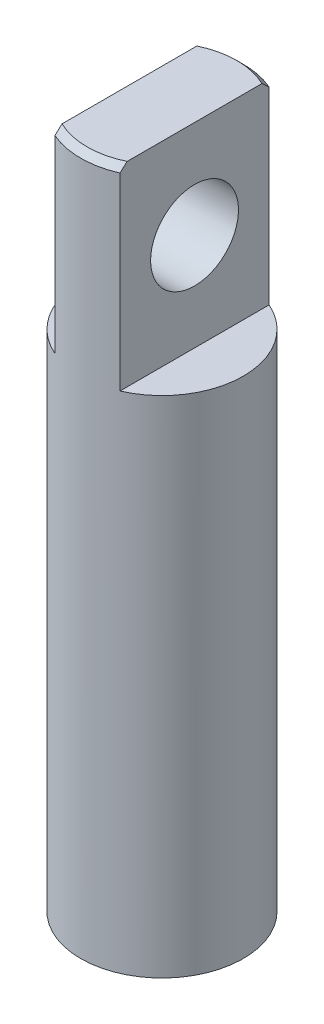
from build123d import *

# Parameters (mm, degrees)
SKETCH1_R           = 2.5
BOSS_EXTRUDE1_DEPTH = 15.5
BOSS_EXTRUDE2_DEPTH = 6
SKETCH4_R           = 1.35
CUT_EXTRUDE2_DEPTH  = 2
CHAMFER1_SIZE       = 0.2


with BuildPart() as part:
    # Sketch1 → Boss-Extrude1 (new body)
    with BuildSketch(Plane(origin=(0, 0, 0), x_dir=(1, 0, 0), z_dir=(0, 1, 0))):
        with Locations(Location((0, 0, 0), (0, 0, 270))):
            Circle(SKETCH1_R)
    extrude(amount=BOSS_EXTRUDE1_DEPTH)

    # Sketch3 → Boss-Extrude2 (add)
    with BuildSketch(Plane(origin=(0, 15.5, 0), x_dir=(1, 0, 0), z_dir=(0, 1, 0))):
        with BuildLine():
            Line((1, -2.291287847), (1, 2.291287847))
            ThreePointArc((1, 2.291287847), (0, 2.5), (-1, 2.291287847))
            Line((-1, 2.291287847), (-1, -2.291287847))
            ThreePointArc((-1, -2.291287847), (0, -2.5), (1, -2.291287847))
        make_face()
    extrude(amount=BOSS_EXTRUDE2_DEPTH)

    # Sketch4 → Cut-Extrude2 (cut)
    with BuildSketch(Plane.ZY.offset(1)):
        with Locations((0, 18.5)):
            Circle(SKETCH4_R)
    extrude(amount=-CUT_EXTRUDE2_DEPTH, mode=Mode.SUBTRACT)

    # Chamfer1
    chamfer1_edges = [part.edges().sort_by_distance(p)[0] for p in [
        (0, 21.5, -2.5),
        (0, 21.5, 2.5),
    ]]
    chamfer(chamfer1_edges, length=CHAMFER1_SIZE)


solid = part.part
